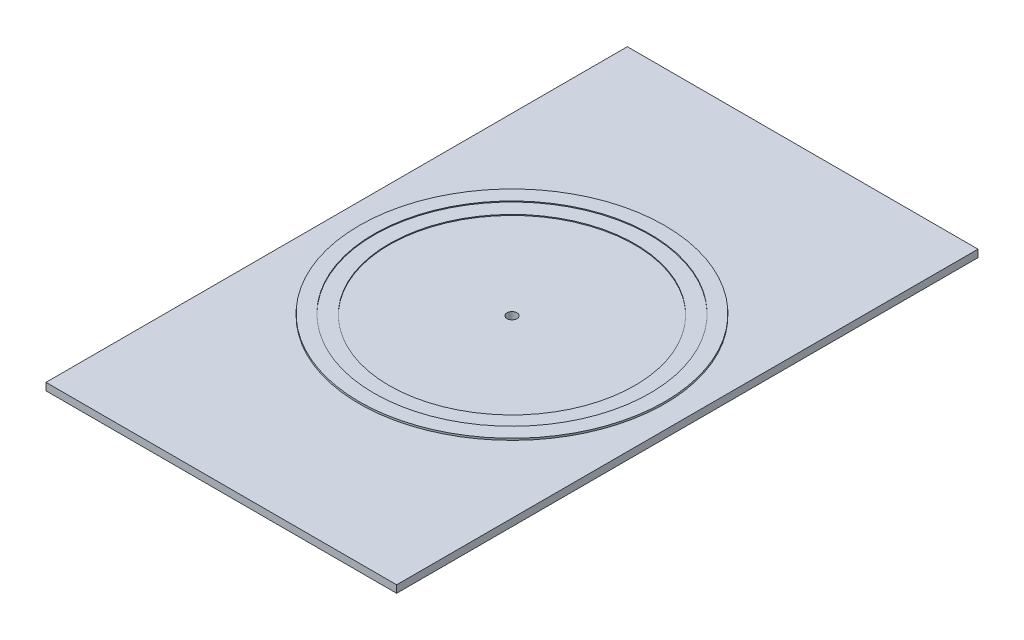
ISO-10303-21;
HEADER;
FILE_DESCRIPTION(('STEP AP214'),'2;1');
FILE_NAME('part.step','',(''),(''),'','','');
FILE_SCHEMA(('AUTOMOTIVE_DESIGN { 1 0 10303 214 1 1 1 1 }'));
ENDSEC;
DATA;
#1=APPLICATION_CONTEXT('core data for automotive mechanical design processes');
#2=APPLICATION_PROTOCOL_DEFINITION('international standard','automotive_design',2000,#1);
#3=PRODUCT_CONTEXT('',#1,'mechanical');
#4=PRODUCT('Part','Part','',(#3));
#5=PRODUCT_RELATED_PRODUCT_CATEGORY('part','',(#4));
#6=PRODUCT_DEFINITION_FORMATION('','',#4);
#7=PRODUCT_DEFINITION_CONTEXT('part definition',#1,'design');
#8=PRODUCT_DEFINITION('design','',#6,#7);
#9=PRODUCT_DEFINITION_SHAPE('','',#8);
#10=(LENGTH_UNIT() NAMED_UNIT(*) SI_UNIT(.MILLI.,.METRE.));
#11=(NAMED_UNIT(*) PLANE_ANGLE_UNIT() SI_UNIT($,.RADIAN.));
#12=(NAMED_UNIT(*) SI_UNIT($,.STERADIAN.) SOLID_ANGLE_UNIT());
#13=UNCERTAINTY_MEASURE_WITH_UNIT(LENGTH_MEASURE(1.E-05),#10,'distance_accuracy_value','');
#14=(GEOMETRIC_REPRESENTATION_CONTEXT(3) GLOBAL_UNCERTAINTY_ASSIGNED_CONTEXT((#13)) GLOBAL_UNIT_ASSIGNED_CONTEXT((#10,
#11,#12)) REPRESENTATION_CONTEXT('',''));
#15=CARTESIAN_POINT('',(0.,0.,0.));
#16=DIRECTION('',(0.,0.,1.));
#17=DIRECTION('',(1.,0.,0.));
#18=AXIS2_PLACEMENT_3D('',#15,#16,#17);
#19=CARTESIAN_POINT('',(0.,4.,0.));
#20=DIRECTION('',(0.,-1.,0.));
#21=DIRECTION('',(0.,0.,-1.));
#22=AXIS2_PLACEMENT_3D('',#19,#20,#21);
#23=PLANE('',#22);
#24=DIRECTION('',(0.,0.,-1.));
#25=VECTOR('',#24,1.);
#26=CARTESIAN_POINT('',(95.,4.,157.5));
#27=LINE('',#26,#25);
#28=CARTESIAN_POINT('',(95.,4.,157.5));
#29=VERTEX_POINT('',#28);
#30=CARTESIAN_POINT('',(95.,4.,-157.5));
#31=VERTEX_POINT('',#30);
#32=EDGE_CURVE('E85',#29,#31,#27,.T.);
#33=ORIENTED_EDGE('',*,*,#32,.T.);
#34=DIRECTION('',(-1.,0.,0.));
#35=VECTOR('',#34,1.);
#36=CARTESIAN_POINT('',(-95.,4.,-157.5));
#37=LINE('',#36,#35);
#38=CARTESIAN_POINT('',(-95.,4.,-157.5));
#39=VERTEX_POINT('',#38);
#40=EDGE_CURVE('E80',#31,#39,#37,.T.);
#41=ORIENTED_EDGE('',*,*,#40,.T.);
#42=DIRECTION('',(0.,0.,1.));
#43=VECTOR('',#42,1.);
#44=CARTESIAN_POINT('',(-95.,4.,157.5));
#45=LINE('',#44,#43);
#46=CARTESIAN_POINT('',(-95.,4.,157.5));
#47=VERTEX_POINT('',#46);
#48=EDGE_CURVE('E83',#39,#47,#45,.T.);
#49=ORIENTED_EDGE('',*,*,#48,.T.);
#50=DIRECTION('',(1.,0.,0.));
#51=VECTOR('',#50,1.);
#52=CARTESIAN_POINT('',(-95.,4.,157.5));
#53=LINE('',#52,#51);
#54=EDGE_CURVE('E49',#47,#29,#53,.T.);
#55=ORIENTED_EDGE('',*,*,#54,.T.);
#56=EDGE_LOOP('',(#33,#41,#49,#55));
#57=FACE_BOUND('',#56,.T.);
#58=CARTESIAN_POINT('',(0.,4.,0.));
#59=DIRECTION('',(0.,-1.,0.));
#60=DIRECTION('',(0.,0.,-1.));
#61=AXIS2_PLACEMENT_3D('',#58,#59,#60);
#62=CIRCLE('',#61,82.725);
#63=CARTESIAN_POINT('',(0.,4.,-82.725));
#64=VERTEX_POINT('',#63);
#65=EDGE_CURVE('E41',#64,#64,#62,.F.);
#66=ORIENTED_EDGE('',*,*,#65,.F.);
#67=EDGE_LOOP('',(#66));
#68=FACE_BOUND('',#67,.T.);
#69=ADVANCED_FACE('F32',(#57,#68),#23,.F.);
#70=CARTESIAN_POINT('',(0.,4.,0.));
#71=DIRECTION('',(0.,1.,0.));
#72=DIRECTION('',(0.,0.,1.));
#73=AXIS2_PLACEMENT_3D('',#70,#71,#72);
#74=CIRCLE('',#73,66.555);
#75=CARTESIAN_POINT('',(0.,4.,66.5549999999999));
#76=VERTEX_POINT('',#75);
#77=EDGE_CURVE('E157',#76,#76,#74,.T.);
#78=ORIENTED_EDGE('',*,*,#77,.T.);
#79=EDGE_LOOP('',(#78));
#80=FACE_BOUND('',#79,.T.);
#81=CARTESIAN_POINT('',(0.,4.,0.));
#82=DIRECTION('',(0.,1.,0.));
#83=DIRECTION('',(0.,0.,1.));
#84=AXIS2_PLACEMENT_3D('',#81,#82,#83);
#85=CIRCLE('',#84,2.75);
#86=CARTESIAN_POINT('',(0.,4.,2.74999999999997));
#87=VERTEX_POINT('',#86);
#88=EDGE_CURVE('E103',#87,#87,#85,.T.);
#89=ORIENTED_EDGE('',*,*,#88,.F.);
#90=EDGE_LOOP('',(#89));
#91=FACE_BOUND('',#90,.T.);
#92=ADVANCED_FACE('F114',(#80,#91),#23,.F.);
#93=CARTESIAN_POINT('',(0.,0.,0.));
#94=DIRECTION('',(0.,-1.,0.));
#95=DIRECTION('',(0.,0.,-1.));
#96=AXIS2_PLACEMENT_3D('',#93,#94,#95);
#97=PLANE('',#96);
#98=CARTESIAN_POINT('',(-93.,0.,-7.5));
#99=DIRECTION('',(0.,-1.,0.));
#100=DIRECTION('',(0.,0.,-1.));
#101=AXIS2_PLACEMENT_3D('',#98,#99,#100);
#102=CIRCLE('',#101,0.999999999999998);
#103=CARTESIAN_POINT('',(-93.,0.,-8.5));
#104=VERTEX_POINT('',#103);
#105=EDGE_CURVE('E211',#104,#104,#102,.T.);
#106=ORIENTED_EDGE('',*,*,#105,.F.);
#107=EDGE_LOOP('',(#106));
#108=FACE_BOUND('',#107,.T.);
#109=CARTESIAN_POINT('',(-93.,0.,7.5));
#110=DIRECTION('',(0.,-1.,0.));
#111=DIRECTION('',(0.,0.,-1.));
#112=AXIS2_PLACEMENT_3D('',#109,#110,#111);
#113=CIRCLE('',#112,0.999999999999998);
#114=CARTESIAN_POINT('',(-93.,0.,6.5));
#115=VERTEX_POINT('',#114);
#116=EDGE_CURVE('E205',#115,#115,#113,.T.);
#117=ORIENTED_EDGE('',*,*,#116,.F.);
#118=EDGE_LOOP('',(#117));
#119=FACE_BOUND('',#118,.T.);
#120=CARTESIAN_POINT('',(-93.,0.,-155.5));
#121=DIRECTION('',(0.,-1.,0.));
#122=DIRECTION('',(0.,0.,-1.));
#123=AXIS2_PLACEMENT_3D('',#120,#121,#122);
#124=CIRCLE('',#123,0.999999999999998);
#125=CARTESIAN_POINT('',(-93.,0.,-156.5));
#126=VERTEX_POINT('',#125);
#127=EDGE_CURVE('E199',#126,#126,#124,.T.);
#128=ORIENTED_EDGE('',*,*,#127,.F.);
#129=EDGE_LOOP('',(#128));
#130=FACE_BOUND('',#129,.T.);
#131=CARTESIAN_POINT('',(0.,0.,-155.5));
#132=DIRECTION('',(0.,-1.,0.));
#133=DIRECTION('',(0.,0.,-1.));
#134=AXIS2_PLACEMENT_3D('',#131,#132,#133);
#135=CIRCLE('',#134,1.);
#136=CARTESIAN_POINT('',(0.,0.,-156.5));
#137=VERTEX_POINT('',#136);
#138=EDGE_CURVE('E193',#137,#137,#135,.T.);
#139=ORIENTED_EDGE('',*,*,#138,.F.);
#140=EDGE_LOOP('',(#139));
#141=FACE_BOUND('',#140,.T.);
#142=CARTESIAN_POINT('',(93.,0.,-155.5));
#143=DIRECTION('',(0.,-1.,0.));
#144=DIRECTION('',(0.,0.,-1.));
#145=AXIS2_PLACEMENT_3D('',#142,#143,#144);
#146=CIRCLE('',#145,0.999999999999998);
#147=CARTESIAN_POINT('',(93.,0.,-156.5));
#148=VERTEX_POINT('',#147);
#149=EDGE_CURVE('E187',#148,#148,#146,.T.);
#150=ORIENTED_EDGE('',*,*,#149,.F.);
#151=EDGE_LOOP('',(#150));
#152=FACE_BOUND('',#151,.T.);
#153=CARTESIAN_POINT('',(93.,0.,0.));
#154=DIRECTION('',(0.,-1.,0.));
#155=DIRECTION('',(0.,0.,-1.));
#156=AXIS2_PLACEMENT_3D('',#153,#154,#155);
#157=CIRCLE('',#156,0.999999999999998);
#158=CARTESIAN_POINT('',(93.,0.,-0.999999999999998));
#159=VERTEX_POINT('',#158);
#160=EDGE_CURVE('E181',#159,#159,#157,.T.);
#161=ORIENTED_EDGE('',*,*,#160,.F.);
#162=EDGE_LOOP('',(#161));
#163=FACE_BOUND('',#162,.T.);
#164=CARTESIAN_POINT('',(93.,0.,155.5));
#165=DIRECTION('',(0.,-1.,0.));
#166=DIRECTION('',(0.,0.,-1.));
#167=AXIS2_PLACEMENT_3D('',#164,#165,#166);
#168=CIRCLE('',#167,0.999999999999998);
#169=CARTESIAN_POINT('',(93.,0.,154.5));
#170=VERTEX_POINT('',#169);
#171=EDGE_CURVE('E175',#170,#170,#168,.T.);
#172=ORIENTED_EDGE('',*,*,#171,.F.);
#173=EDGE_LOOP('',(#172));
#174=FACE_BOUND('',#173,.T.);
#175=CARTESIAN_POINT('',(0.,0.,155.5));
#176=DIRECTION('',(0.,-1.,0.));
#177=DIRECTION('',(0.,0.,-1.));
#178=AXIS2_PLACEMENT_3D('',#175,#176,#177);
#179=CIRCLE('',#178,1.);
#180=CARTESIAN_POINT('',(0.,0.,154.5));
#181=VERTEX_POINT('',#180);
#182=EDGE_CURVE('E169',#181,#181,#179,.T.);
#183=ORIENTED_EDGE('',*,*,#182,.F.);
#184=EDGE_LOOP('',(#183));
#185=FACE_BOUND('',#184,.T.);
#186=CARTESIAN_POINT('',(-93.,0.,155.5));
#187=DIRECTION('',(0.,-1.,0.));
#188=DIRECTION('',(0.,0.,-1.));
#189=AXIS2_PLACEMENT_3D('',#186,#187,#188);
#190=CIRCLE('',#189,0.999999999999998);
#191=CARTESIAN_POINT('',(-93.,0.,154.5));
#192=VERTEX_POINT('',#191);
#193=EDGE_CURVE('E163',#192,#192,#190,.T.);
#194=ORIENTED_EDGE('',*,*,#193,.F.);
#195=EDGE_LOOP('',(#194));
#196=FACE_BOUND('',#195,.T.);
#197=DIRECTION('',(0.,0.,-1.));
#198=VECTOR('',#197,1.);
#199=CARTESIAN_POINT('',(95.,0.,157.5));
#200=LINE('',#199,#198);
#201=CARTESIAN_POINT('',(95.,0.,157.5));
#202=VERTEX_POINT('',#201);
#203=CARTESIAN_POINT('',(95.,0.,-157.5));
#204=VERTEX_POINT('',#203);
#205=EDGE_CURVE('E100',#202,#204,#200,.T.);
#206=ORIENTED_EDGE('',*,*,#205,.F.);
#207=DIRECTION('',(1.,0.,0.));
#208=VECTOR('',#207,1.);
#209=CARTESIAN_POINT('',(-95.,0.,157.5));
#210=LINE('',#209,#208);
#211=CARTESIAN_POINT('',(-95.,0.,157.5));
#212=VERTEX_POINT('',#211);
#213=EDGE_CURVE('E72',#212,#202,#210,.T.);
#214=ORIENTED_EDGE('',*,*,#213,.F.);
#215=DIRECTION('',(0.,0.,1.));
#216=VECTOR('',#215,1.);
#217=CARTESIAN_POINT('',(-95.,0.,157.5));
#218=LINE('',#217,#216);
#219=CARTESIAN_POINT('',(-95.,0.,-157.5));
#220=VERTEX_POINT('',#219);
#221=EDGE_CURVE('E66',#220,#212,#218,.T.);
#222=ORIENTED_EDGE('',*,*,#221,.F.);
#223=DIRECTION('',(-1.,0.,0.));
#224=VECTOR('',#223,1.);
#225=CARTESIAN_POINT('',(-95.,0.,-157.5));
#226=LINE('',#225,#224);
#227=EDGE_CURVE('E90',#204,#220,#226,.T.);
#228=ORIENTED_EDGE('',*,*,#227,.F.);
#229=EDGE_LOOP('',(#206,#214,#222,#228));
#230=FACE_BOUND('',#229,.T.);
#231=CARTESIAN_POINT('',(0.,0.,0.));
#232=DIRECTION('',(0.,1.,0.));
#233=DIRECTION('',(0.,0.,1.));
#234=AXIS2_PLACEMENT_3D('',#231,#232,#233);
#235=CIRCLE('',#234,2.75);
#236=CARTESIAN_POINT('',(0.,0.,2.74999999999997));
#237=VERTEX_POINT('',#236);
#238=EDGE_CURVE('E144',#237,#237,#235,.T.);
#239=ORIENTED_EDGE('',*,*,#238,.T.);
#240=EDGE_LOOP('',(#239));
#241=FACE_BOUND('',#240,.T.);
#242=ADVANCED_FACE('F119',(#108,#119,#130,#141,#152,#163,#174,#185,#196,#230,#241),#97,.T.);
#243=CARTESIAN_POINT('',(95.,4.,157.5));
#244=DIRECTION('',(-1.,0.,0.));
#245=DIRECTION('',(0.,0.,1.));
#246=AXIS2_PLACEMENT_3D('',#243,#244,#245);
#247=PLANE('',#246);
#248=ORIENTED_EDGE('',*,*,#205,.T.);
#249=DIRECTION('',(0.,-1.,0.));
#250=VECTOR('',#249,1.);
#251=CARTESIAN_POINT('',(95.,4.,-157.5));
#252=LINE('',#251,#250);
#253=EDGE_CURVE('E91',#31,#204,#252,.T.);
#254=ORIENTED_EDGE('',*,*,#253,.F.);
#255=ORIENTED_EDGE('',*,*,#32,.F.);
#256=DIRECTION('',(0.,-1.,0.));
#257=VECTOR('',#256,1.);
#258=CARTESIAN_POINT('',(95.,4.,157.5));
#259=LINE('',#258,#257);
#260=EDGE_CURVE('E96',#29,#202,#259,.T.);
#261=ORIENTED_EDGE('',*,*,#260,.T.);
#262=EDGE_LOOP('',(#248,#254,#255,#261));
#263=FACE_BOUND('',#262,.T.);
#264=ADVANCED_FACE('F34',(#263),#247,.F.);
#265=CARTESIAN_POINT('',(-95.,4.,-157.5));
#266=DIRECTION('',(0.,0.,1.));
#267=DIRECTION('',(1.,0.,0.));
#268=AXIS2_PLACEMENT_3D('',#265,#266,#267);
#269=PLANE('',#268);
#270=ORIENTED_EDGE('',*,*,#227,.T.);
#271=DIRECTION('',(0.,-1.,0.));
#272=VECTOR('',#271,1.);
#273=CARTESIAN_POINT('',(-95.,4.,-157.5));
#274=LINE('',#273,#272);
#275=EDGE_CURVE('E88',#39,#220,#274,.T.);
#276=ORIENTED_EDGE('',*,*,#275,.F.);
#277=ORIENTED_EDGE('',*,*,#40,.F.);
#278=ORIENTED_EDGE('',*,*,#253,.T.);
#279=EDGE_LOOP('',(#270,#276,#277,#278));
#280=FACE_BOUND('',#279,.T.);
#281=ADVANCED_FACE('F89',(#280),#269,.F.);
#282=CARTESIAN_POINT('',(-95.,4.,157.5));
#283=DIRECTION('',(1.,0.,0.));
#284=DIRECTION('',(0.,0.,-1.));
#285=AXIS2_PLACEMENT_3D('',#282,#283,#284);
#286=PLANE('',#285);
#287=ORIENTED_EDGE('',*,*,#221,.T.);
#288=DIRECTION('',(0.,-1.,0.));
#289=VECTOR('',#288,1.);
#290=CARTESIAN_POINT('',(-95.,4.,157.5));
#291=LINE('',#290,#289);
#292=EDGE_CURVE('E92',#47,#212,#291,.T.);
#293=ORIENTED_EDGE('',*,*,#292,.F.);
#294=ORIENTED_EDGE('',*,*,#48,.F.);
#295=ORIENTED_EDGE('',*,*,#275,.T.);
#296=EDGE_LOOP('',(#287,#293,#294,#295));
#297=FACE_BOUND('',#296,.T.);
#298=ADVANCED_FACE('F94',(#297),#286,.F.);
#299=CARTESIAN_POINT('',(-95.,4.,157.5));
#300=DIRECTION('',(0.,0.,-1.));
#301=DIRECTION('',(-1.,0.,0.));
#302=AXIS2_PLACEMENT_3D('',#299,#300,#301);
#303=PLANE('',#302);
#304=ORIENTED_EDGE('',*,*,#213,.T.);
#305=ORIENTED_EDGE('',*,*,#260,.F.);
#306=ORIENTED_EDGE('',*,*,#54,.F.);
#307=ORIENTED_EDGE('',*,*,#292,.T.);
#308=EDGE_LOOP('',(#304,#305,#306,#307));
#309=FACE_BOUND('',#308,.T.);
#310=ADVANCED_FACE('F128',(#309),#303,.F.);
#311=CARTESIAN_POINT('',(0.,4.,0.));
#312=DIRECTION('',(0.,-1.,0.));
#313=DIRECTION('',(0.,0.,-1.));
#314=AXIS2_PLACEMENT_3D('',#311,#312,#313);
#315=CYLINDRICAL_SURFACE('',#314,2.75);
#316=ORIENTED_EDGE('',*,*,#88,.T.);
#317=EDGE_LOOP('',(#316));
#318=FACE_BOUND('',#317,.T.);
#319=ORIENTED_EDGE('',*,*,#238,.F.);
#320=EDGE_LOOP('',(#319));
#321=FACE_BOUND('',#320,.T.);
#322=ADVANCED_FACE('F123',(#318,#321),#315,.F.);
#323=CARTESIAN_POINT('',(0.,5.,0.));
#324=DIRECTION('',(0.,1.,0.));
#325=DIRECTION('',(0.,0.,1.));
#326=AXIS2_PLACEMENT_3D('',#323,#324,#325);
#327=PLANE('',#326);
#328=CARTESIAN_POINT('',(0.,5.,0.));
#329=DIRECTION('',(0.,1.,0.));
#330=DIRECTION('',(0.,0.,1.));
#331=AXIS2_PLACEMENT_3D('',#328,#329,#330);
#332=CIRCLE('',#331,82.725);
#333=CARTESIAN_POINT('',(0.,5.,82.725));
#334=VERTEX_POINT('',#333);
#335=EDGE_CURVE('E146',#334,#334,#332,.T.);
#336=ORIENTED_EDGE('',*,*,#335,.T.);
#337=EDGE_LOOP('',(#336));
#338=FACE_BOUND('',#337,.T.);
#339=CARTESIAN_POINT('',(0.,5.,0.));
#340=DIRECTION('',(0.,1.,0.));
#341=DIRECTION('',(0.,0.,1.));
#342=AXIS2_PLACEMENT_3D('',#339,#340,#341);
#343=CIRCLE('',#342,74.765);
#344=CARTESIAN_POINT('',(0.,5.,74.765));
#345=VERTEX_POINT('',#344);
#346=EDGE_CURVE('E151',#345,#345,#343,.T.);
#347=ORIENTED_EDGE('',*,*,#346,.F.);
#348=EDGE_LOOP('',(#347));
#349=FACE_BOUND('',#348,.T.);
#350=ADVANCED_FACE('F268',(#338,#349),#327,.T.);
#351=CARTESIAN_POINT('',(0.,5.,0.));
#352=DIRECTION('',(0.,-1.,0.));
#353=DIRECTION('',(0.,0.,-1.));
#354=AXIS2_PLACEMENT_3D('',#351,#352,#353);
#355=CYLINDRICAL_SURFACE('',#354,82.725);
#356=ORIENTED_EDGE('',*,*,#335,.F.);
#357=EDGE_LOOP('',(#356));
#358=FACE_BOUND('',#357,.T.);
#359=ORIENTED_EDGE('',*,*,#65,.T.);
#360=EDGE_LOOP('',(#359));
#361=FACE_BOUND('',#360,.T.);
#362=ADVANCED_FACE('F112',(#358,#361),#355,.T.);
#363=CARTESIAN_POINT('',(0.,5.,0.));
#364=DIRECTION('',(0.,-1.,0.));
#365=DIRECTION('',(0.,0.,-1.));
#366=AXIS2_PLACEMENT_3D('',#363,#364,#365);
#367=CYLINDRICAL_SURFACE('',#366,74.765);
#368=CARTESIAN_POINT('',(0.,4.5,0.));
#369=DIRECTION('',(0.,1.,0.));
#370=DIRECTION('',(0.,0.,1.));
#371=AXIS2_PLACEMENT_3D('',#368,#369,#370);
#372=CIRCLE('',#371,74.765);
#373=CARTESIAN_POINT('',(0.,4.5,74.765));
#374=VERTEX_POINT('',#373);
#375=EDGE_CURVE('E11',#374,#374,#372,.T.);
#376=ORIENTED_EDGE('',*,*,#375,.F.);
#377=EDGE_LOOP('',(#376));
#378=FACE_BOUND('',#377,.T.);
#379=ORIENTED_EDGE('',*,*,#346,.T.);
#380=EDGE_LOOP('',(#379));
#381=FACE_BOUND('',#380,.T.);
#382=ADVANCED_FACE('F263',(#378,#381),#367,.F.);
#383=CARTESIAN_POINT('',(0.,4.5,0.));
#384=DIRECTION('',(0.,1.,0.));
#385=DIRECTION('',(0.,0.,1.));
#386=AXIS2_PLACEMENT_3D('',#383,#384,#385);
#387=PLANE('',#386);
#388=ORIENTED_EDGE('',*,*,#375,.T.);
#389=EDGE_LOOP('',(#388));
#390=FACE_BOUND('',#389,.T.);
#391=CARTESIAN_POINT('',(0.,4.5,0.));
#392=DIRECTION('',(0.,1.,0.));
#393=DIRECTION('',(0.,0.,1.));
#394=AXIS2_PLACEMENT_3D('',#391,#392,#393);
#395=CIRCLE('',#394,66.555);
#396=CARTESIAN_POINT('',(0.,4.5,66.5549999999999));
#397=VERTEX_POINT('',#396);
#398=EDGE_CURVE('E156',#397,#397,#395,.T.);
#399=ORIENTED_EDGE('',*,*,#398,.F.);
#400=EDGE_LOOP('',(#399));
#401=FACE_BOUND('',#400,.T.);
#402=ADVANCED_FACE('F255',(#390,#401),#387,.T.);
#403=CARTESIAN_POINT('',(0.,4.5,0.));
#404=DIRECTION('',(0.,-1.,0.));
#405=DIRECTION('',(0.,0.,-1.));
#406=AXIS2_PLACEMENT_3D('',#403,#404,#405);
#407=CYLINDRICAL_SURFACE('',#406,66.555);
#408=ORIENTED_EDGE('',*,*,#398,.T.);
#409=EDGE_LOOP('',(#408));
#410=FACE_BOUND('',#409,.T.);
#411=ORIENTED_EDGE('',*,*,#77,.F.);
#412=EDGE_LOOP('',(#411));
#413=FACE_BOUND('',#412,.T.);
#414=ADVANCED_FACE('F245',(#410,#413),#407,.F.);
#415=CARTESIAN_POINT('',(-93.,2.,155.5));
#416=DIRECTION('',(0.,-1.,0.));
#417=DIRECTION('',(0.,0.,-1.));
#418=AXIS2_PLACEMENT_3D('',#415,#416,#417);
#419=CYLINDRICAL_SURFACE('',#418,0.999999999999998);
#420=CARTESIAN_POINT('',(-93.,2.,155.5));
#421=DIRECTION('',(0.,-1.,0.));
#422=DIRECTION('',(0.,0.,-1.));
#423=AXIS2_PLACEMENT_3D('',#420,#421,#422);
#424=CIRCLE('',#423,0.999999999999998);
#425=CARTESIAN_POINT('',(-93.,2.,154.5));
#426=VERTEX_POINT('',#425);
#427=EDGE_CURVE('E160',#426,#426,#424,.T.);
#428=ORIENTED_EDGE('',*,*,#427,.F.);
#429=EDGE_LOOP('',(#428));
#430=FACE_BOUND('',#429,.T.);
#431=ORIENTED_EDGE('',*,*,#193,.T.);
#432=EDGE_LOOP('',(#431));
#433=FACE_BOUND('',#432,.T.);
#434=ADVANCED_FACE('F242',(#430,#433),#419,.F.);
#435=CARTESIAN_POINT('',(-93.,2.,155.5));
#436=DIRECTION('',(0.,-1.,0.));
#437=DIRECTION('',(0.,0.,-1.));
#438=AXIS2_PLACEMENT_3D('',#435,#436,#437);
#439=PLANE('',#438);
#440=ORIENTED_EDGE('',*,*,#427,.T.);
#441=EDGE_LOOP('',(#440));
#442=FACE_BOUND('',#441,.T.);
#443=ADVANCED_FACE('F244',(#442),#439,.T.);
#444=CARTESIAN_POINT('',(0.,2.,155.5));
#445=DIRECTION('',(0.,-1.,0.));
#446=DIRECTION('',(0.,0.,-1.));
#447=AXIS2_PLACEMENT_3D('',#444,#445,#446);
#448=CYLINDRICAL_SURFACE('',#447,1.);
#449=CARTESIAN_POINT('',(0.,2.,155.5));
#450=DIRECTION('',(0.,-1.,0.));
#451=DIRECTION('',(0.,0.,-1.));
#452=AXIS2_PLACEMENT_3D('',#449,#450,#451);
#453=CIRCLE('',#452,1.);
#454=CARTESIAN_POINT('',(0.,2.,154.5));
#455=VERTEX_POINT('',#454);
#456=EDGE_CURVE('E166',#455,#455,#453,.T.);
#457=ORIENTED_EDGE('',*,*,#456,.F.);
#458=EDGE_LOOP('',(#457));
#459=FACE_BOUND('',#458,.T.);
#460=ORIENTED_EDGE('',*,*,#182,.T.);
#461=EDGE_LOOP('',(#460));
#462=FACE_BOUND('',#461,.T.);
#463=ADVANCED_FACE('F252',(#459,#462),#448,.F.);
#464=CARTESIAN_POINT('',(0.,2.,155.5));
#465=DIRECTION('',(0.,-1.,0.));
#466=DIRECTION('',(0.,0.,-1.));
#467=AXIS2_PLACEMENT_3D('',#464,#465,#466);
#468=PLANE('',#467);
#469=ORIENTED_EDGE('',*,*,#456,.T.);
#470=EDGE_LOOP('',(#469));
#471=FACE_BOUND('',#470,.T.);
#472=ADVANCED_FACE('F322',(#471),#468,.T.);
#473=CARTESIAN_POINT('',(93.,2.,155.5));
#474=DIRECTION('',(0.,-1.,0.));
#475=DIRECTION('',(0.,0.,-1.));
#476=AXIS2_PLACEMENT_3D('',#473,#474,#475);
#477=CYLINDRICAL_SURFACE('',#476,0.999999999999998);
#478=CARTESIAN_POINT('',(93.,2.,155.5));
#479=DIRECTION('',(0.,-1.,0.));
#480=DIRECTION('',(0.,0.,-1.));
#481=AXIS2_PLACEMENT_3D('',#478,#479,#480);
#482=CIRCLE('',#481,0.999999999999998);
#483=CARTESIAN_POINT('',(93.,2.,154.5));
#484=VERTEX_POINT('',#483);
#485=EDGE_CURVE('E172',#484,#484,#482,.T.);
#486=ORIENTED_EDGE('',*,*,#485,.F.);
#487=EDGE_LOOP('',(#486));
#488=FACE_BOUND('',#487,.T.);
#489=ORIENTED_EDGE('',*,*,#171,.T.);
#490=EDGE_LOOP('',(#489));
#491=FACE_BOUND('',#490,.T.);
#492=ADVANCED_FACE('F331',(#488,#491),#477,.F.);
#493=CARTESIAN_POINT('',(93.,2.,155.5));
#494=DIRECTION('',(0.,-1.,0.));
#495=DIRECTION('',(0.,0.,-1.));
#496=AXIS2_PLACEMENT_3D('',#493,#494,#495);
#497=PLANE('',#496);
#498=ORIENTED_EDGE('',*,*,#485,.T.);
#499=EDGE_LOOP('',(#498));
#500=FACE_BOUND('',#499,.T.);
#501=ADVANCED_FACE('F341',(#500),#497,.T.);
#502=CARTESIAN_POINT('',(93.,2.,0.));
#503=DIRECTION('',(0.,-1.,0.));
#504=DIRECTION('',(0.,0.,-1.));
#505=AXIS2_PLACEMENT_3D('',#502,#503,#504);
#506=CYLINDRICAL_SURFACE('',#505,0.999999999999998);
#507=CARTESIAN_POINT('',(93.,2.,0.));
#508=DIRECTION('',(0.,-1.,0.));
#509=DIRECTION('',(0.,0.,-1.));
#510=AXIS2_PLACEMENT_3D('',#507,#508,#509);
#511=CIRCLE('',#510,0.999999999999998);
#512=CARTESIAN_POINT('',(93.,2.,-0.999999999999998));
#513=VERTEX_POINT('',#512);
#514=EDGE_CURVE('E178',#513,#513,#511,.T.);
#515=ORIENTED_EDGE('',*,*,#514,.F.);
#516=EDGE_LOOP('',(#515));
#517=FACE_BOUND('',#516,.T.);
#518=ORIENTED_EDGE('',*,*,#160,.T.);
#519=EDGE_LOOP('',(#518));
#520=FACE_BOUND('',#519,.T.);
#521=ADVANCED_FACE('F351',(#517,#520),#506,.F.);
#522=CARTESIAN_POINT('',(93.,2.,0.));
#523=DIRECTION('',(0.,-1.,0.));
#524=DIRECTION('',(0.,0.,-1.));
#525=AXIS2_PLACEMENT_3D('',#522,#523,#524);
#526=PLANE('',#525);
#527=ORIENTED_EDGE('',*,*,#514,.T.);
#528=EDGE_LOOP('',(#527));
#529=FACE_BOUND('',#528,.T.);
#530=ADVANCED_FACE('F361',(#529),#526,.T.);
#531=CARTESIAN_POINT('',(93.,2.,-155.5));
#532=DIRECTION('',(0.,-1.,0.));
#533=DIRECTION('',(0.,0.,-1.));
#534=AXIS2_PLACEMENT_3D('',#531,#532,#533);
#535=CYLINDRICAL_SURFACE('',#534,0.999999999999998);
#536=CARTESIAN_POINT('',(93.,2.,-155.5));
#537=DIRECTION('',(0.,-1.,0.));
#538=DIRECTION('',(0.,0.,-1.));
#539=AXIS2_PLACEMENT_3D('',#536,#537,#538);
#540=CIRCLE('',#539,0.999999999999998);
#541=CARTESIAN_POINT('',(93.,2.,-156.5));
#542=VERTEX_POINT('',#541);
#543=EDGE_CURVE('E184',#542,#542,#540,.T.);
#544=ORIENTED_EDGE('',*,*,#543,.F.);
#545=EDGE_LOOP('',(#544));
#546=FACE_BOUND('',#545,.T.);
#547=ORIENTED_EDGE('',*,*,#149,.T.);
#548=EDGE_LOOP('',(#547));
#549=FACE_BOUND('',#548,.T.);
#550=ADVANCED_FACE('F371',(#546,#549),#535,.F.);
#551=CARTESIAN_POINT('',(93.,2.,-155.5));
#552=DIRECTION('',(0.,-1.,0.));
#553=DIRECTION('',(0.,0.,-1.));
#554=AXIS2_PLACEMENT_3D('',#551,#552,#553);
#555=PLANE('',#554);
#556=ORIENTED_EDGE('',*,*,#543,.T.);
#557=EDGE_LOOP('',(#556));
#558=FACE_BOUND('',#557,.T.);
#559=ADVANCED_FACE('F381',(#558),#555,.T.);
#560=CARTESIAN_POINT('',(0.,2.,-155.5));
#561=DIRECTION('',(0.,-1.,0.));
#562=DIRECTION('',(0.,0.,-1.));
#563=AXIS2_PLACEMENT_3D('',#560,#561,#562);
#564=CYLINDRICAL_SURFACE('',#563,1.);
#565=CARTESIAN_POINT('',(0.,2.,-155.5));
#566=DIRECTION('',(0.,-1.,0.));
#567=DIRECTION('',(0.,0.,-1.));
#568=AXIS2_PLACEMENT_3D('',#565,#566,#567);
#569=CIRCLE('',#568,1.);
#570=CARTESIAN_POINT('',(0.,2.,-156.5));
#571=VERTEX_POINT('',#570);
#572=EDGE_CURVE('E190',#571,#571,#569,.T.);
#573=ORIENTED_EDGE('',*,*,#572,.F.);
#574=EDGE_LOOP('',(#573));
#575=FACE_BOUND('',#574,.T.);
#576=ORIENTED_EDGE('',*,*,#138,.T.);
#577=EDGE_LOOP('',(#576));
#578=FACE_BOUND('',#577,.T.);
#579=ADVANCED_FACE('F391',(#575,#578),#564,.F.);
#580=CARTESIAN_POINT('',(0.,2.,-155.5));
#581=DIRECTION('',(0.,-1.,0.));
#582=DIRECTION('',(0.,0.,-1.));
#583=AXIS2_PLACEMENT_3D('',#580,#581,#582);
#584=PLANE('',#583);
#585=ORIENTED_EDGE('',*,*,#572,.T.);
#586=EDGE_LOOP('',(#585));
#587=FACE_BOUND('',#586,.T.);
#588=ADVANCED_FACE('F401',(#587),#584,.T.);
#589=CARTESIAN_POINT('',(-93.,2.,-155.5));
#590=DIRECTION('',(0.,-1.,0.));
#591=DIRECTION('',(0.,0.,-1.));
#592=AXIS2_PLACEMENT_3D('',#589,#590,#591);
#593=CYLINDRICAL_SURFACE('',#592,0.999999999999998);
#594=CARTESIAN_POINT('',(-93.,2.,-155.5));
#595=DIRECTION('',(0.,-1.,0.));
#596=DIRECTION('',(0.,0.,-1.));
#597=AXIS2_PLACEMENT_3D('',#594,#595,#596);
#598=CIRCLE('',#597,0.999999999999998);
#599=CARTESIAN_POINT('',(-93.,2.,-156.5));
#600=VERTEX_POINT('',#599);
#601=EDGE_CURVE('E196',#600,#600,#598,.T.);
#602=ORIENTED_EDGE('',*,*,#601,.F.);
#603=EDGE_LOOP('',(#602));
#604=FACE_BOUND('',#603,.T.);
#605=ORIENTED_EDGE('',*,*,#127,.T.);
#606=EDGE_LOOP('',(#605));
#607=FACE_BOUND('',#606,.T.);
#608=ADVANCED_FACE('F411',(#604,#607),#593,.F.);
#609=CARTESIAN_POINT('',(-93.,2.,-155.5));
#610=DIRECTION('',(0.,-1.,0.));
#611=DIRECTION('',(0.,0.,-1.));
#612=AXIS2_PLACEMENT_3D('',#609,#610,#611);
#613=PLANE('',#612);
#614=ORIENTED_EDGE('',*,*,#601,.T.);
#615=EDGE_LOOP('',(#614));
#616=FACE_BOUND('',#615,.T.);
#617=ADVANCED_FACE('F421',(#616),#613,.T.);
#618=CARTESIAN_POINT('',(-93.,2.,7.5));
#619=DIRECTION('',(0.,-1.,0.));
#620=DIRECTION('',(0.,0.,-1.));
#621=AXIS2_PLACEMENT_3D('',#618,#619,#620);
#622=CYLINDRICAL_SURFACE('',#621,0.999999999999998);
#623=CARTESIAN_POINT('',(-93.,2.,7.5));
#624=DIRECTION('',(0.,-1.,0.));
#625=DIRECTION('',(0.,0.,-1.));
#626=AXIS2_PLACEMENT_3D('',#623,#624,#625);
#627=CIRCLE('',#626,0.999999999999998);
#628=CARTESIAN_POINT('',(-93.,2.,6.5));
#629=VERTEX_POINT('',#628);
#630=EDGE_CURVE('E202',#629,#629,#627,.T.);
#631=ORIENTED_EDGE('',*,*,#630,.F.);
#632=EDGE_LOOP('',(#631));
#633=FACE_BOUND('',#632,.T.);
#634=ORIENTED_EDGE('',*,*,#116,.T.);
#635=EDGE_LOOP('',(#634));
#636=FACE_BOUND('',#635,.T.);
#637=ADVANCED_FACE('F431',(#633,#636),#622,.F.);
#638=CARTESIAN_POINT('',(-93.,2.,7.5));
#639=DIRECTION('',(0.,-1.,0.));
#640=DIRECTION('',(0.,0.,-1.));
#641=AXIS2_PLACEMENT_3D('',#638,#639,#640);
#642=PLANE('',#641);
#643=ORIENTED_EDGE('',*,*,#630,.T.);
#644=EDGE_LOOP('',(#643));
#645=FACE_BOUND('',#644,.T.);
#646=ADVANCED_FACE('F222',(#645),#642,.T.);
#647=CARTESIAN_POINT('',(-93.,2.,-7.5));
#648=DIRECTION('',(0.,-1.,0.));
#649=DIRECTION('',(0.,0.,-1.));
#650=AXIS2_PLACEMENT_3D('',#647,#648,#649);
#651=CYLINDRICAL_SURFACE('',#650,0.999999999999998);
#652=CARTESIAN_POINT('',(-93.,2.,-7.5));
#653=DIRECTION('',(0.,-1.,0.));
#654=DIRECTION('',(0.,0.,-1.));
#655=AXIS2_PLACEMENT_3D('',#652,#653,#654);
#656=CIRCLE('',#655,0.999999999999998);
#657=CARTESIAN_POINT('',(-93.,2.,-8.5));
#658=VERTEX_POINT('',#657);
#659=EDGE_CURVE('E208',#658,#658,#656,.T.);
#660=ORIENTED_EDGE('',*,*,#659,.F.);
#661=EDGE_LOOP('',(#660));
#662=FACE_BOUND('',#661,.T.);
#663=ORIENTED_EDGE('',*,*,#105,.T.);
#664=EDGE_LOOP('',(#663));
#665=FACE_BOUND('',#664,.T.);
#666=ADVANCED_FACE('F219',(#662,#665),#651,.F.);
#667=CARTESIAN_POINT('',(-93.,2.,-7.5));
#668=DIRECTION('',(0.,-1.,0.));
#669=DIRECTION('',(0.,0.,-1.));
#670=AXIS2_PLACEMENT_3D('',#667,#668,#669);
#671=PLANE('',#670);
#672=ORIENTED_EDGE('',*,*,#659,.T.);
#673=EDGE_LOOP('',(#672));
#674=FACE_BOUND('',#673,.T.);
#675=ADVANCED_FACE('F217',(#674),#671,.T.);
#676=CLOSED_SHELL('',(#69,#92,#242,#264,#281,#298,#310,#322,#350,#362,#382,#402,#414,#434,#443,
#463,#472,#492,#501,#521,#530,#550,#559,#579,#588,#608,#617,#637,#646,#666,#675));
#677=MANIFOLD_SOLID_BREP('B2',#676);
#678=ADVANCED_BREP_SHAPE_REPRESENTATION('',(#18,#677),#14);
#679=SHAPE_DEFINITION_REPRESENTATION(#9,#678);
ENDSEC;
END-ISO-10303-21;
